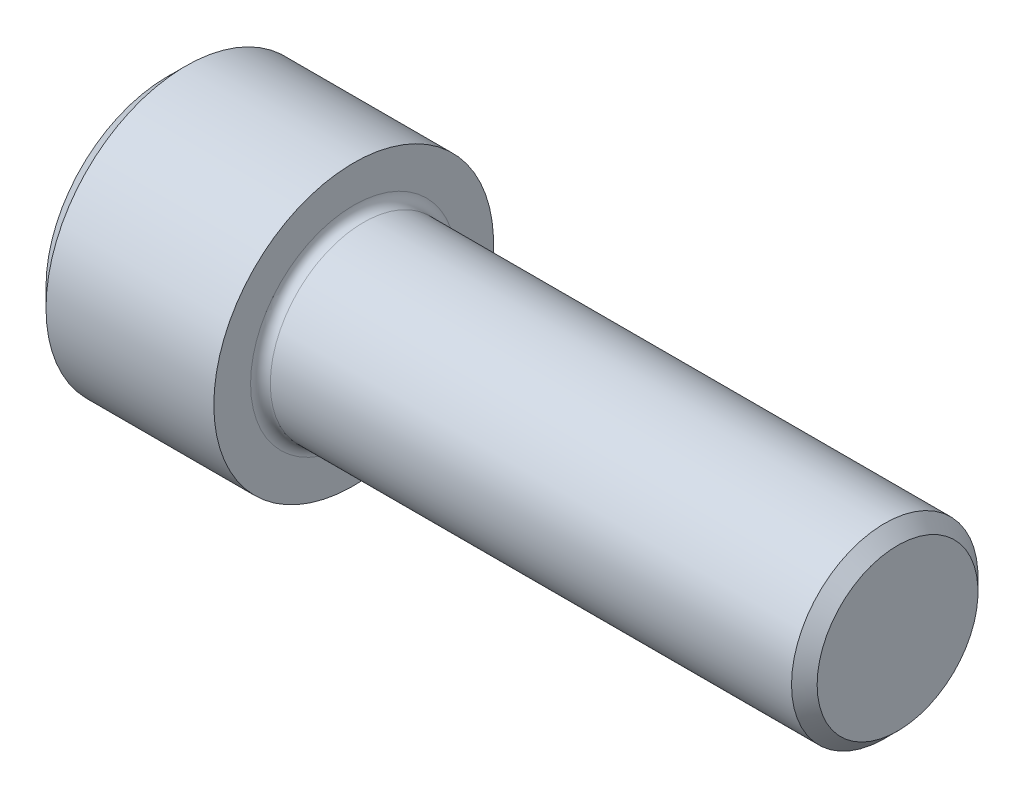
from build123d import *

# Parameters (mm, degrees)
FILLET1_R   = 1.27
HEX_2_DEPTH = 12


with BuildPart() as part:
    # BodySke → Base-Revolve (revolve)
    with BuildSketch(Plane.XY, mode=Mode.PRIVATE) as base_revolve_sk:
        Polygon((0, 0), (0, 15.6), (2.4, 18), (24, 18), (24, 12), (92.352, 12), (94, 10.352), (94, 0), align=None)
    revolve(base_revolve_sk.sketch.rotate(Axis((-31.75, 0, 0), (1, 0, 0)), 90), axis=Axis((-31.75, 0, 0), (1, 0, 0)))

    # Fillet1
    fillet1_edges = [part.edges().sort_by_distance(p)[0] for p in [
        (24, 0, -12),
    ]]
    fillet(fillet1_edges, radius=FILLET1_R)

    # Sketch2 → Hex-PreBroach (revolve, cut)
    with BuildSketch(Plane.XY, mode=Mode.PRIVATE) as hex_prebroach_sk:
        Polygon((0, 9.5), (12, 9.5), (17.484827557, 0), (0, 0), align=None)
    revolve(hex_prebroach_sk.sketch.rotate(Axis((0, 0, 0), (1, 0, 0)), 90), axis=Axis((0, 0, 0), (1, 0, 0)), mode=Mode.SUBTRACT)

    # Sketch3 → Hex 2 (cut)
    with BuildSketch(Plane(origin=(0, 0, 0), x_dir=(0, 0.500000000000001, 0.866025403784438), z_dir=(-1, 0, 0))):
        Polygon((5.484827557, 9.5), (-5.484827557, 9.5), (-10.969655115, 0), (-5.484827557, -9.5), (5.484827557, -9.5), (10.969655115, 0), align=None)
    extrude(amount=-HEX_2_DEPTH, mode=Mode.SUBTRACT)


solid = part.part
